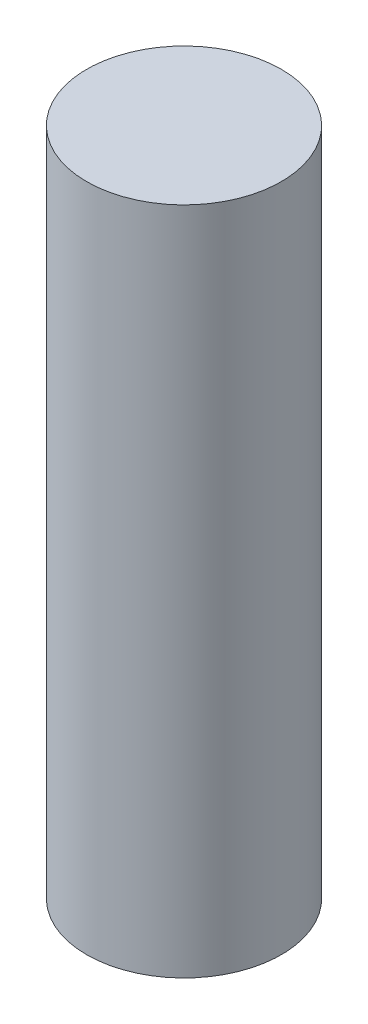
ISO-10303-21;
HEADER;
FILE_DESCRIPTION(('STEP AP214'),'2;1');
FILE_NAME('part.step','',(''),(''),'','','');
FILE_SCHEMA(('AUTOMOTIVE_DESIGN { 1 0 10303 214 1 1 1 1 }'));
ENDSEC;
DATA;
#1=APPLICATION_CONTEXT('core data for automotive mechanical design processes');
#2=APPLICATION_PROTOCOL_DEFINITION('international standard','automotive_design',2000,#1);
#3=PRODUCT_CONTEXT('',#1,'mechanical');
#4=PRODUCT('Part','Part','',(#3));
#5=PRODUCT_RELATED_PRODUCT_CATEGORY('part','',(#4));
#6=PRODUCT_DEFINITION_FORMATION('','',#4);
#7=PRODUCT_DEFINITION_CONTEXT('part definition',#1,'design');
#8=PRODUCT_DEFINITION('design','',#6,#7);
#9=PRODUCT_DEFINITION_SHAPE('','',#8);
#10=(LENGTH_UNIT() NAMED_UNIT(*) SI_UNIT(.MILLI.,.METRE.));
#11=(NAMED_UNIT(*) PLANE_ANGLE_UNIT() SI_UNIT($,.RADIAN.));
#12=(NAMED_UNIT(*) SI_UNIT($,.STERADIAN.) SOLID_ANGLE_UNIT());
#13=UNCERTAINTY_MEASURE_WITH_UNIT(LENGTH_MEASURE(1.E-05),#10,'distance_accuracy_value','');
#14=(GEOMETRIC_REPRESENTATION_CONTEXT(3) GLOBAL_UNCERTAINTY_ASSIGNED_CONTEXT((#13)) GLOBAL_UNIT_ASSIGNED_CONTEXT((#10,
#11,#12)) REPRESENTATION_CONTEXT('',''));
#15=CARTESIAN_POINT('',(0.,0.,0.));
#16=DIRECTION('',(0.,0.,1.));
#17=DIRECTION('',(1.,0.,0.));
#18=AXIS2_PLACEMENT_3D('',#15,#16,#17);
#19=CARTESIAN_POINT('',(0.,16.51,0.));
#20=DIRECTION('',(0.,-1.,0.));
#21=DIRECTION('',(0.,0.,-1.));
#22=AXIS2_PLACEMENT_3D('',#19,#20,#21);
#23=CYLINDRICAL_SURFACE('',#22,2.4003);
#24=CARTESIAN_POINT('',(0.,16.51,0.));
#25=DIRECTION('',(0.,1.,0.));
#26=DIRECTION('',(0.,0.,1.));
#27=AXIS2_PLACEMENT_3D('',#24,#25,#26);
#28=CIRCLE('',#27,2.4003);
#29=CARTESIAN_POINT('',(0.,16.51,2.4003));
#30=VERTEX_POINT('',#29);
#31=EDGE_CURVE('E10',#30,#30,#28,.T.);
#32=ORIENTED_EDGE('',*,*,#31,.F.);
#33=EDGE_LOOP('',(#32));
#34=FACE_BOUND('',#33,.T.);
#35=CARTESIAN_POINT('',(0.,0.,0.));
#36=DIRECTION('',(0.,1.,0.));
#37=DIRECTION('',(0.,0.,1.));
#38=AXIS2_PLACEMENT_3D('',#35,#36,#37);
#39=CIRCLE('',#38,2.4003);
#40=CARTESIAN_POINT('',(0.,0.,2.4003));
#41=VERTEX_POINT('',#40);
#42=EDGE_CURVE('E34',#41,#41,#39,.T.);
#43=ORIENTED_EDGE('',*,*,#42,.T.);
#44=EDGE_LOOP('',(#43));
#45=FACE_BOUND('',#44,.T.);
#46=ADVANCED_FACE('F31',(#34,#45),#23,.T.);
#47=CARTESIAN_POINT('',(0.,16.51,0.));
#48=DIRECTION('',(0.,1.,0.));
#49=DIRECTION('',(0.,0.,1.));
#50=AXIS2_PLACEMENT_3D('',#47,#48,#49);
#51=PLANE('',#50);
#52=ORIENTED_EDGE('',*,*,#31,.T.);
#53=EDGE_LOOP('',(#52));
#54=FACE_BOUND('',#53,.T.);
#55=ADVANCED_FACE('F46',(#54),#51,.T.);
#56=CARTESIAN_POINT('',(0.,0.,0.));
#57=DIRECTION('',(0.,1.,0.));
#58=DIRECTION('',(0.,0.,1.));
#59=AXIS2_PLACEMENT_3D('',#56,#57,#58);
#60=PLANE('',#59);
#61=ORIENTED_EDGE('',*,*,#42,.F.);
#62=EDGE_LOOP('',(#61));
#63=FACE_BOUND('',#62,.T.);
#64=ADVANCED_FACE('F44',(#63),#60,.F.);
#65=CLOSED_SHELL('',(#46,#55,#64));
#66=MANIFOLD_SOLID_BREP('B2',#65);
#67=ADVANCED_BREP_SHAPE_REPRESENTATION('',(#18,#66),#14);
#68=SHAPE_DEFINITION_REPRESENTATION(#9,#67);
ENDSEC;
END-ISO-10303-21;
